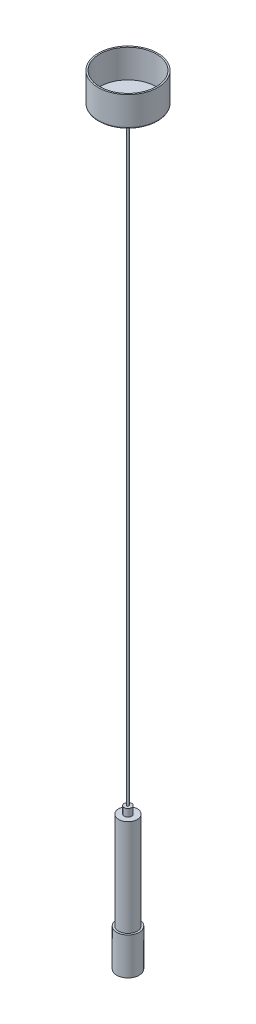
from build123d import *

# Parameters (mm, degrees)
CROQUIS1_R              = 12.5
SALIENTE_EXTRUIR1_DEPTH = 130
CROQUIS2_R              = 15
SALIENTE_EXTRUIR2_DEPTH = 50
CROQUIS3_R              = 5
SALIENTE_EXTRUIR3_DEPTH = 10
CROQUIS4_R              = 1.25
SALIENTE_EXTRUIR4_DEPTH = 800
CROQUIS5_R              = 5
SALIENTE_EXTRUIR5_DEPTH = 15
CROQUIS6_R              = 40
SALIENTE_EXTRUIR6_DEPTH = 40
REDONDEO1_R             = 2
VACIADO1_T              = -2
CROQUIS7_R              = 11
CORTAR_EXTRUIR1_DEPTH   = 3
CROQUIS8_R              = 11
SALIENTE_EXTRUIR7_DEPTH = 3


with BuildPart() as part:
    # Croquis1 → Saliente-Extruir1 (new body)
    with BuildSketch(Plane(origin=(0, 0, 0), x_dir=(1, 0, 0), z_dir=(0, 1, 0))):
        with Locations(Location((0, 0, 0), (0, 0, 270))):
            Circle(CROQUIS1_R)
    extrude(amount=SALIENTE_EXTRUIR1_DEPTH)


with BuildPart() as body_2:
    # Croquis2 → Saliente-Extruir2 (new body)
    with BuildSketch(Plane.XZ):
        with Locations(Location((0, 0, 0), (0, 0, 270))):
            Circle(CROQUIS2_R)
    extrude(amount=SALIENTE_EXTRUIR2_DEPTH)

    # Croquis7 → Cortar-Extruir1 (cut)
    with BuildSketch(Plane.XZ.offset(50)):
        with Locations(Location((0, 0, 0), (0, 0, 270))):
            Circle(CROQUIS7_R)
    extrude(amount=-CORTAR_EXTRUIR1_DEPTH, mode=Mode.SUBTRACT)


with BuildPart() as body_3:
    # Croquis3 → Saliente-Extruir3 (new body)
    with BuildSketch(Plane(origin=(0, 130, 0), x_dir=(1, 0, 0), z_dir=(0, 1, 0))):
        with Locations(Location((0, 0, 0), (0, 0, 270))):
            Circle(CROQUIS3_R)
    extrude(amount=SALIENTE_EXTRUIR3_DEPTH)


with BuildPart() as body_4:
    # Croquis4 → Saliente-Extruir4 (new body)
    with BuildSketch(Plane(origin=(0, 140, 0), x_dir=(1, 0, 0), z_dir=(0, 1, 0))):
        with Locations(Location((0, 0, 0), (0, 0, 270))):
            Circle(CROQUIS4_R)
    extrude(amount=SALIENTE_EXTRUIR4_DEPTH)


with BuildPart() as body_5:
    # Croquis5 → Saliente-Extruir5 (new body)
    with BuildSketch(Plane(origin=(0, 940, 0), x_dir=(1, 0, 0), z_dir=(0, 1, 0))):
        with Locations(Location((0, 0, 0), (0, 0, 270))):
            Circle(CROQUIS5_R)
    extrude(amount=SALIENTE_EXTRUIR5_DEPTH)


with BuildPart() as body_6:
    # Croquis6 → Saliente-Extruir6 (new body)
    with BuildSketch(Plane(origin=(0, 955, 0), x_dir=(1, 0, 0), z_dir=(0, 1, 0))):
        with Locations(Location((0, 0, 0), (0, 0, 270))):
            Circle(CROQUIS6_R)
    extrude(amount=SALIENTE_EXTRUIR6_DEPTH)

    # Redondeo1
    redondeo1_edges = [body_6.edges().sort_by_distance(p)[0] for p in [
        (0, 955, -40),
    ]]
    fillet(redondeo1_edges, radius=REDONDEO1_R)

    # Vaciado1
    vaciado1_openings = [body_6.faces().sort_by_distance(p)[0] for p in [
        (0, 995, 0),
    ]]
    offset(amount=VACIADO1_T, openings=vaciado1_openings, kind=Kind.INTERSECTION)


with BuildPart() as body_7:
    # Croquis8 → Saliente-Extruir7 (new body)
    with BuildSketch(Plane.XZ.offset(47)):
        with Locations(Location((0, 0, 0), (0, 0, 270))):
            Circle(CROQUIS8_R)
    extrude(amount=SALIENTE_EXTRUIR7_DEPTH)


solid = Compound([part.part, body_2.part, body_3.part, body_4.part, body_5.part, body_6.part, body_7.part])
